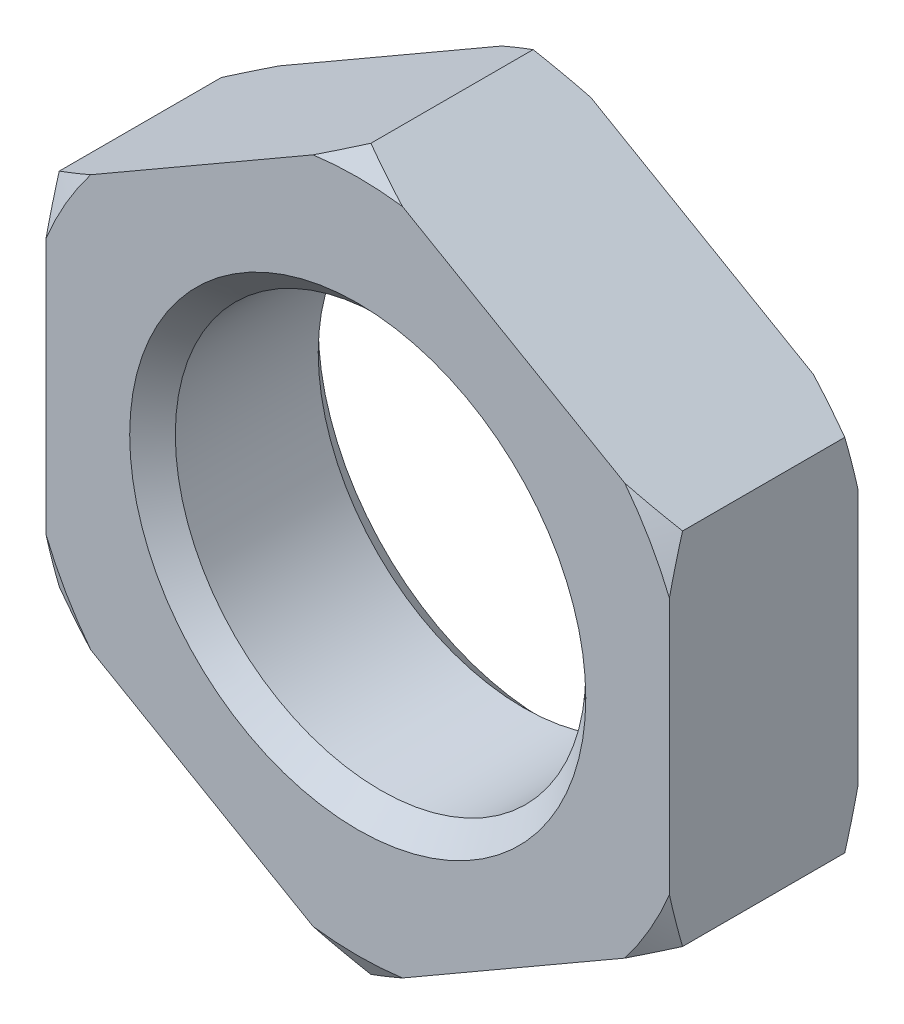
from build123d import *

# Parameters (mm, degrees)
SKETCH1_R           = 13.5
BOSS_EXTRUDE1_DEPTH = 6.2
CHAMFER1_SIZE       = 1.5


with BuildPart() as part:
    # Sketch1 → Boss-Extrude1 (new, symmetric)
    with BuildSketch(Plane.XY):
        Polygon((0, 23.671361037), (-20.5, 11.835680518), (-20.5, -11.835680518), (0, -23.671361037), (20.5, -11.835680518), (20.5, 11.835680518), align=None)
        with Locations(Location((0, 0, 0), (0, 0, 180))):
            Circle(SKETCH1_R, mode=Mode.SUBTRACT)
    extrude(amount=BOSS_EXTRUDE1_DEPTH, both=True)

    # Sketch3 → Cut-Revolve1 (revolve, cut)
    with BuildSketch(Plane(origin=(0, 0, 0), x_dir=(0, 0, -1), z_dir=(1, 0, 0))):
        Polygon((-6.2, 23.671361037), (-6.2, 22.171361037), (-5.333974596, 23.671361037), align=None)
    cut_revolve1 = revolve(axis=Axis((0, 0, -7.477018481), (0, 0, 1)), mode=Mode.SUBTRACT)

    # Mirror1: Cut-Revolve1 across plane
    add(cut_revolve1.mirror(Plane.XY), mode=Mode.SUBTRACT)

    # Chamfer1
    chamfer1_edges = [part.edges().sort_by_distance(p)[0] for p in [
        (13.5, 0, -6.2),
        (13.5, 0, 6.2),
    ]]
    chamfer(chamfer1_edges, length=CHAMFER1_SIZE)


solid = part.part
